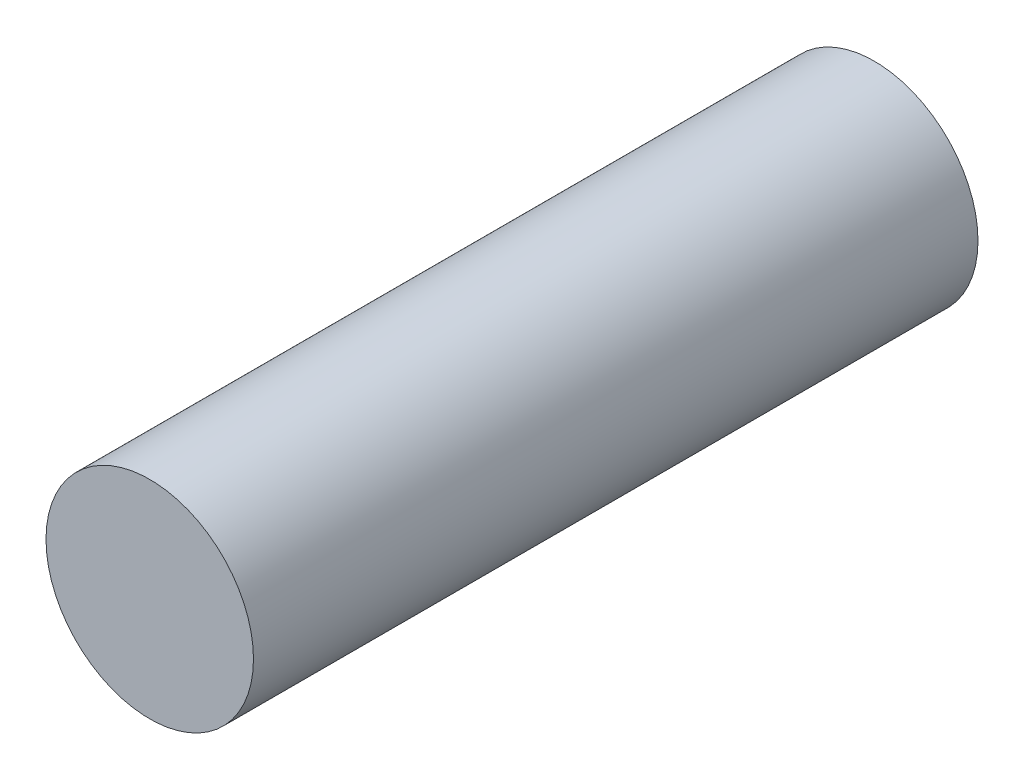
from build123d import *

# Parameters (mm, degrees)
SKETCH2_R           = 4.0005
BOSS_EXTRUDE1_DEPTH = 27.94


with BuildPart() as part:
    # Sketch2 → Boss-Extrude1 (new body)
    with BuildSketch(Plane.XY):
        Circle(SKETCH2_R)
    extrude(amount=BOSS_EXTRUDE1_DEPTH)


solid = part.part
